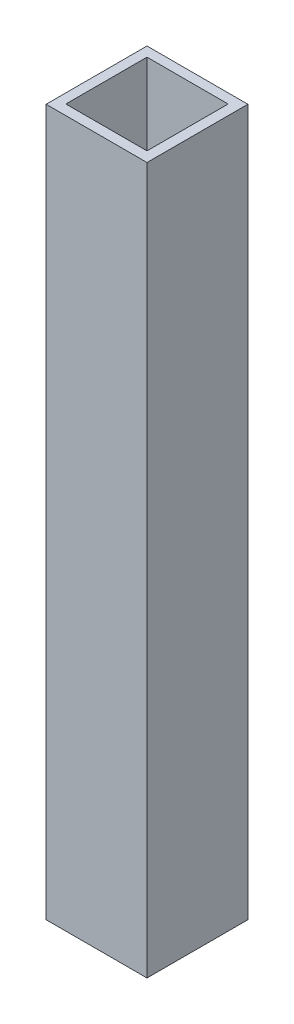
from build123d import *

# Parameters (mm, degrees)
ESQUISSE1_W        = 10
ESQUISSE1_H        = 10
ESQUISSE1_W_2      = 8.042723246
ESQUISSE1_H_2      = 8.042723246
BOSS_EXTRU_1_DEPTH = 70


with BuildPart() as part:
    # Esquisse1 → Boss.-Extru.1 (new body)
    with BuildSketch(Plane(origin=(0, 0, 0), x_dir=(1, 0, 0), z_dir=(0, 1, 0))):
        with Locations((0.021361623, -0.021361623)):
            Rectangle(ESQUISSE1_W, ESQUISSE1_H)
        Rectangle(ESQUISSE1_W_2, ESQUISSE1_H_2, mode=Mode.SUBTRACT)
    extrude(amount=BOSS_EXTRU_1_DEPTH)


solid = part.part
